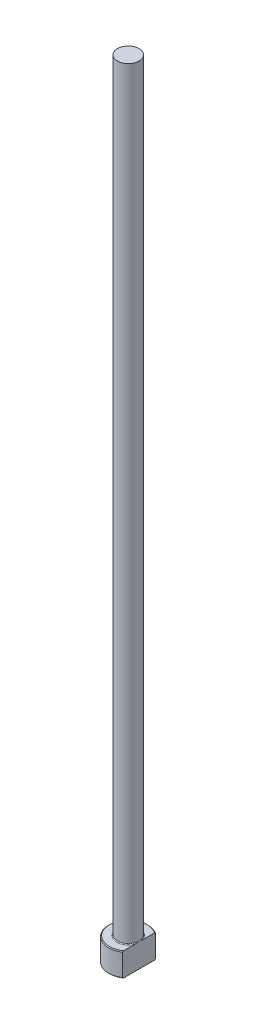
ISO-10303-21;
HEADER;
FILE_DESCRIPTION(('STEP AP214'),'2;1');
FILE_NAME('part.step','',(''),(''),'','','');
FILE_SCHEMA(('AUTOMOTIVE_DESIGN { 1 0 10303 214 1 1 1 1 }'));
ENDSEC;
DATA;
#1=APPLICATION_CONTEXT('core data for automotive mechanical design processes');
#2=APPLICATION_PROTOCOL_DEFINITION('international standard','automotive_design',2000,#1);
#3=PRODUCT_CONTEXT('',#1,'mechanical');
#4=PRODUCT('Part','Part','',(#3));
#5=PRODUCT_RELATED_PRODUCT_CATEGORY('part','',(#4));
#6=PRODUCT_DEFINITION_FORMATION('','',#4);
#7=PRODUCT_DEFINITION_CONTEXT('part definition',#1,'design');
#8=PRODUCT_DEFINITION('design','',#6,#7);
#9=PRODUCT_DEFINITION_SHAPE('','',#8);
#10=(LENGTH_UNIT() NAMED_UNIT(*) SI_UNIT(.MILLI.,.METRE.));
#11=(NAMED_UNIT(*) PLANE_ANGLE_UNIT() SI_UNIT($,.RADIAN.));
#12=(NAMED_UNIT(*) SI_UNIT($,.STERADIAN.) SOLID_ANGLE_UNIT());
#13=UNCERTAINTY_MEASURE_WITH_UNIT(LENGTH_MEASURE(1.E-05),#10,'distance_accuracy_value','');
#14=(GEOMETRIC_REPRESENTATION_CONTEXT(3) GLOBAL_UNCERTAINTY_ASSIGNED_CONTEXT((#13)) GLOBAL_UNIT_ASSIGNED_CONTEXT((#10,
#11,#12)) REPRESENTATION_CONTEXT('',''));
#15=CARTESIAN_POINT('',(0.,0.,0.));
#16=DIRECTION('',(0.,0.,1.));
#17=DIRECTION('',(1.,0.,0.));
#18=AXIS2_PLACEMENT_3D('',#15,#16,#17);
#19=CARTESIAN_POINT('',(0.,0.,0.));
#20=DIRECTION('',(0.,-1.,0.));
#21=DIRECTION('',(0.,0.,-1.));
#22=AXIS2_PLACEMENT_3D('',#19,#20,#21);
#23=PLANE('',#22);
#24=CARTESIAN_POINT('',(0.,0.,0.));
#25=DIRECTION('',(0.,-1.,0.));
#26=DIRECTION('',(0.,0.,-1.));
#27=AXIS2_PLACEMENT_3D('',#24,#25,#26);
#28=CIRCLE('',#27,4.79999999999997);
#29=CARTESIAN_POINT('',(2.74999999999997,0.,3.93414539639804));
#30=VERTEX_POINT('',#29);
#31=CARTESIAN_POINT('',(2.74999999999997,0.,-3.93414539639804));
#32=VERTEX_POINT('',#31);
#33=EDGE_CURVE('E98',#30,#32,#28,.T.);
#34=ORIENTED_EDGE('',*,*,#33,.T.);
#35=DIRECTION('',(0.,0.,1.));
#36=VECTOR('',#35,1.);
#37=CARTESIAN_POINT('',(2.74999999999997,0.,4.1758232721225));
#38=LINE('',#37,#36);
#39=EDGE_CURVE('E83',#32,#30,#38,.T.);
#40=ORIENTED_EDGE('',*,*,#39,.T.);
#41=EDGE_LOOP('',(#34,#40));
#42=FACE_BOUND('',#41,.T.);
#43=ADVANCED_FACE('F32',(#42),#23,.T.);
#44=CARTESIAN_POINT('',(0.,259.958771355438,0.));
#45=DIRECTION('',(0.,1.,0.));
#46=DIRECTION('',(0.,0.,1.));
#47=AXIS2_PLACEMENT_3D('',#44,#45,#46);
#48=CYLINDRICAL_SURFACE('',#47,4.99999999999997);
#49=CARTESIAN_POINT('',(0.,5.79999999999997,0.));
#50=DIRECTION('',(0.,1.,0.));
#51=DIRECTION('',(0.,0.,1.));
#52=AXIS2_PLACEMENT_3D('',#49,#50,#51);
#53=CIRCLE('',#52,4.99999999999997);
#54=CARTESIAN_POINT('',(2.74999999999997,5.79999999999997,4.1758232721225));
#55=VERTEX_POINT('',#54);
#56=CARTESIAN_POINT('',(2.74999999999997,5.79999999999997,-4.1758232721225));
#57=VERTEX_POINT('',#56);
#58=EDGE_CURVE('E104',#55,#57,#53,.F.);
#59=ORIENTED_EDGE('',*,*,#58,.T.);
#60=DIRECTION('',(0.,-1.,0.));
#61=VECTOR('',#60,1.);
#62=CARTESIAN_POINT('',(2.74999999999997,200.,-4.1758232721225));
#63=LINE('',#62,#61);
#64=CARTESIAN_POINT('',(2.74999999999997,0.200000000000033,-4.1758232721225));
#65=VERTEX_POINT('',#64);
#66=EDGE_CURVE('E183',#57,#65,#63,.T.);
#67=ORIENTED_EDGE('',*,*,#66,.T.);
#68=CARTESIAN_POINT('',(0.,0.200000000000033,0.));
#69=DIRECTION('',(0.,-1.,0.));
#70=DIRECTION('',(0.,0.,-1.));
#71=AXIS2_PLACEMENT_3D('',#68,#69,#70);
#72=CIRCLE('',#71,4.99999999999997);
#73=CARTESIAN_POINT('',(2.74999999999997,0.200000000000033,4.1758232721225));
#74=VERTEX_POINT('',#73);
#75=EDGE_CURVE('E100',#65,#74,#72,.F.);
#76=ORIENTED_EDGE('',*,*,#75,.T.);
#77=DIRECTION('',(0.,-1.,0.));
#78=VECTOR('',#77,1.);
#79=CARTESIAN_POINT('',(2.74999999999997,200.,4.1758232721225));
#80=LINE('',#79,#78);
#81=EDGE_CURVE('E93',#55,#74,#80,.T.);
#82=ORIENTED_EDGE('',*,*,#81,.F.);
#83=EDGE_LOOP('',(#59,#67,#76,#82));
#84=FACE_BOUND('',#83,.T.);
#85=ADVANCED_FACE('F158',(#84),#48,.T.);
#86=CARTESIAN_POINT('',(-4.99999999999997,6.,0.));
#87=DIRECTION('',(0.,1.,0.));
#88=DIRECTION('',(0.,0.,1.));
#89=AXIS2_PLACEMENT_3D('',#86,#87,#88);
#90=PLANE('',#89);
#91=CARTESIAN_POINT('',(0.,6.,0.));
#92=DIRECTION('',(0.,1.,0.));
#93=DIRECTION('',(0.,0.,1.));
#94=AXIS2_PLACEMENT_3D('',#91,#92,#93);
#95=CIRCLE('',#94,4.79999999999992);
#96=CARTESIAN_POINT('',(2.74999999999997,6.,-3.93414539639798));
#97=VERTEX_POINT('',#96);
#98=CARTESIAN_POINT('',(2.74999999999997,6.,3.93414539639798));
#99=VERTEX_POINT('',#98);
#100=EDGE_CURVE('E178',#97,#99,#95,.T.);
#101=ORIENTED_EDGE('',*,*,#100,.T.);
#102=DIRECTION('',(0.,0.,-1.));
#103=VECTOR('',#102,1.);
#104=CARTESIAN_POINT('',(2.74999999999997,6.,0.));
#105=LINE('',#104,#103);
#106=CARTESIAN_POINT('',(2.74999999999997,5.99999999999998,1.06770782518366));
#107=VERTEX_POINT('',#106);
#108=EDGE_CURVE('E57',#99,#107,#105,.T.);
#109=ORIENTED_EDGE('',*,*,#108,.T.);
#110=CARTESIAN_POINT('',(0.,6.,0.));
#111=DIRECTION('',(0.,1.,0.));
#112=DIRECTION('',(0.,0.,1.));
#113=AXIS2_PLACEMENT_3D('',#110,#111,#112);
#114=CIRCLE('',#113,2.94999999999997);
#115=CARTESIAN_POINT('',(2.74999999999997,5.99999999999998,-1.06770782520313));
#116=VERTEX_POINT('',#115);
#117=EDGE_CURVE('E107',#107,#116,#114,.F.);
#118=ORIENTED_EDGE('',*,*,#117,.T.);
#119=EDGE_CURVE('E136',#116,#97,#105,.T.);
#120=ORIENTED_EDGE('',*,*,#119,.T.);
#121=EDGE_LOOP('',(#101,#109,#118,#120));
#122=FACE_BOUND('',#121,.T.);
#123=ADVANCED_FACE('F147',(#122),#90,.T.);
#124=CARTESIAN_POINT('',(0.,6.00000000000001,0.));
#125=DIRECTION('',(0.,-1.,0.));
#126=DIRECTION('',(0.,0.,-1.));
#127=AXIS2_PLACEMENT_3D('',#124,#125,#126);
#128=CONICAL_SURFACE('',#127,4.79999999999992,0.785398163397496);
#129=ORIENTED_EDGE('',*,*,#58,.F.);
#130=CARTESIAN_POINT('',(2.74999999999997,1.20885441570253,9.18844783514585));
#131=CARTESIAN_POINT('',(2.74999999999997,1.37523675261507,9.0147689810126));
#132=CARTESIAN_POINT('',(2.74999999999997,1.54142180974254,8.84090089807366));
#133=CARTESIAN_POINT('',(2.74999999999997,1.87331224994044,8.49270511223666));
#134=CARTESIAN_POINT('',(2.74999999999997,2.03901762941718,8.31837740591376));
#135=CARTESIAN_POINT('',(2.74999999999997,2.53536746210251,7.79449769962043));
#136=CARTESIAN_POINT('',(2.74999999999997,2.86516041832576,7.44413786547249));
#137=CARTESIAN_POINT('',(2.74999999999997,3.52140645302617,6.74030951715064));
#138=CARTESIAN_POINT('',(2.74999999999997,3.84785962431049,6.38684108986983));
#139=CARTESIAN_POINT('',(2.74999999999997,4.33353933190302,5.85303151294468));
#140=CARTESIAN_POINT('',(2.74999999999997,4.49475728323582,5.67450358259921));
#141=CARTESIAN_POINT('',(2.74999999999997,4.81545552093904,5.31589537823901));
#142=CARTESIAN_POINT('',(2.74999999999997,4.97493583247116,5.1358151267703));
#143=CARTESIAN_POINT('',(2.74999999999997,5.28246157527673,4.78409714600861));
#144=CARTESIAN_POINT('',(2.74999999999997,5.43063567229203,4.6125721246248));
#145=CARTESIAN_POINT('',(2.74999999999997,5.72427023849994,4.26717959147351));
#146=CARTESIAN_POINT('',(2.74999999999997,5.86973045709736,4.09331186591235));
#147=CARTESIAN_POINT('',(2.74999999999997,6.15716227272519,3.74214491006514));
#148=CARTESIAN_POINT('',(2.74999999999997,6.29912659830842,3.56483970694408));
#149=CARTESIAN_POINT('',(2.74999999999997,6.57763983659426,3.20603939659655));
#150=CARTESIAN_POINT('',(2.74999999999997,6.71418980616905,3.02454511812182));
#151=CARTESIAN_POINT('',(2.74999999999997,6.93857405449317,2.71219163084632));
#152=CARTESIAN_POINT('',(2.74999999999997,7.02851673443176,2.58285434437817));
#153=CARTESIAN_POINT('',(2.74999999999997,7.20308451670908,2.3205424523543));
#154=CARTESIAN_POINT('',(2.74999999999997,7.28770764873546,2.18756652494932));
#155=CARTESIAN_POINT('',(2.74999999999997,7.4493195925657,1.9173567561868));
#156=CARTESIAN_POINT('',(2.74999999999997,7.52632375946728,1.7801322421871));
#157=CARTESIAN_POINT('',(2.74999999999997,7.66966790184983,1.50031327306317));
#158=CARTESIAN_POINT('',(2.74999999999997,7.7360172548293,1.35772367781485));
#159=CARTESIAN_POINT('',(2.74999999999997,7.86065113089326,1.04856386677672));
#160=CARTESIAN_POINT('',(2.74999999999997,7.9170079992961,0.88117116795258));
#161=CARTESIAN_POINT('',(2.74999999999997,7.98102802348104,0.625229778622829));
#162=CARTESIAN_POINT('',(2.74999999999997,7.99893817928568,0.539229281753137));
#163=CARTESIAN_POINT('',(2.74999999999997,8.02707157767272,0.365959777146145));
#164=CARTESIAN_POINT('',(2.74999999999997,8.03729562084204,0.278690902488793));
#165=CARTESIAN_POINT('',(2.74999999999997,8.0494923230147,0.102763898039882));
#166=CARTESIAN_POINT('',(2.74999999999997,8.05138838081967,0.0141003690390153));
#167=CARTESIAN_POINT('',(2.74999999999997,8.04659669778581,-0.162990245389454));
#168=CARTESIAN_POINT('',(2.74999999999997,8.03990892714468,-0.251417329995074));
#169=CARTESIAN_POINT('',(2.74999999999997,8.01835539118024,-0.427430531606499));
#170=CARTESIAN_POINT('',(2.74999999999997,8.00347341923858,-0.515014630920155));
#171=CARTESIAN_POINT('',(2.74999999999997,7.9663672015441,-0.688602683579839));
#172=CARTESIAN_POINT('',(2.74999999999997,7.94414138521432,-0.774606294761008));
#173=CARTESIAN_POINT('',(2.74999999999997,7.88037969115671,-0.988315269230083));
#174=CARTESIAN_POINT('',(2.74999999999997,7.83478497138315,-1.11480587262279));
#175=CARTESIAN_POINT('',(2.74999999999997,7.7327190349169,-1.36329985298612));
#176=CARTESIAN_POINT('',(2.74999999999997,7.67623944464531,-1.48529968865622));
#177=CARTESIAN_POINT('',(2.74999999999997,7.5549822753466,-1.72582737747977));
#178=CARTESIAN_POINT('',(2.74999999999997,7.4901643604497,-1.84433466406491));
#179=CARTESIAN_POINT('',(2.74999999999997,7.38849038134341,-2.01944141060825));
#180=CARTESIAN_POINT('',(2.74999999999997,7.3538638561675,-2.07735876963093));
#181=CARTESIAN_POINT('',(2.74999999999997,7.28331846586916,-2.19239883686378));
#182=CARTESIAN_POINT('',(2.74999999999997,7.24739965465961,-2.24952157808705));
#183=CARTESIAN_POINT('',(2.74999999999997,7.12488368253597,-2.44019263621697));
#184=CARTESIAN_POINT('',(2.74999999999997,7.0357483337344,-2.57211125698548));
#185=CARTESIAN_POINT('',(2.74999999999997,6.85300432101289,-2.83282496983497));
#186=CARTESIAN_POINT('',(2.74999999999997,6.75939460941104,-2.96161931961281));
#187=CARTESIAN_POINT('',(2.74999999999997,6.5687848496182,-3.2168121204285));
#188=CARTESIAN_POINT('',(2.74999999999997,6.47178237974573,-3.34320875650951));
#189=CARTESIAN_POINT('',(2.74999999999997,6.275243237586,-3.59402090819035));
#190=CARTESIAN_POINT('',(2.74999999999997,6.17570641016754,-3.71843630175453));
#191=CARTESIAN_POINT('',(2.74999999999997,5.97442282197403,-3.96596722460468));
#192=CARTESIAN_POINT('',(2.74999999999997,5.87267126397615,-4.08907884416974));
#193=CARTESIAN_POINT('',(2.74999999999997,5.6676012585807,-4.33399167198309));
#194=CARTESIAN_POINT('',(2.74999999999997,5.56428277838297,-4.45579285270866));
#195=CARTESIAN_POINT('',(2.74999999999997,5.25255029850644,-4.81947940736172));
#196=CARTESIAN_POINT('',(2.74999999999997,5.04226620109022,-5.0597609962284));
#197=CARTESIAN_POINT('',(2.74999999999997,4.61812846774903,-5.53760543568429));
#198=CARTESIAN_POINT('',(2.74999999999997,4.40427119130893,-5.77516503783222));
#199=CARTESIAN_POINT('',(2.74999999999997,3.97415714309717,-6.24814387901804));
#200=CARTESIAN_POINT('',(2.74999999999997,3.75790012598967,-6.48356289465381));
#201=CARTESIAN_POINT('',(2.74999999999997,3.32391192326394,-6.95249982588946));
#202=CARTESIAN_POINT('',(2.74999999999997,3.10618287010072,-7.18601971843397));
#203=CARTESIAN_POINT('',(2.74999999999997,2.66941287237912,-7.65182952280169));
#204=CARTESIAN_POINT('',(2.74999999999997,2.45037192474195,-7.88411943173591));
#205=CARTESIAN_POINT('',(2.74999999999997,2.14586495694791,-8.2056307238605));
#206=CARTESIAN_POINT('',(2.74999999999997,2.06083046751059,-8.29526139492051));
#207=CARTESIAN_POINT('',(2.74999999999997,1.89060889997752,-8.47440444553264));
#208=CARTESIAN_POINT('',(2.74999999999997,1.80542180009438,-8.56391680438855));
#209=CARTESIAN_POINT('',(2.74999999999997,1.63506457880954,-8.74266965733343));
#210=CARTESIAN_POINT('',(2.74999999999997,1.54989467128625,-8.83191035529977));
#211=CARTESIAN_POINT('',(2.74999999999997,1.37945223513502,-9.01026683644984));
#212=CARTESIAN_POINT('',(2.74999999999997,1.2941797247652,-9.09938263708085));
#213=CARTESIAN_POINT('',(2.74999999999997,1.20885441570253,-9.18844783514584));
#214=B_SPLINE_CURVE_WITH_KNOTS('',3,(#130,#131,#132,#133,#134,#135,#136,#137,#138,#139,#140,
#141,#142,#143,#144,#145,#146,#147,#148,#149,#150,#151,#152,#153,#154,#155,#156,#157,#158,#159,
#160,#161,#162,#163,#164,#165,#166,#167,#168,#169,#170,#171,#172,#173,#174,#175,#176,#177,#178,
#179,#180,#181,#182,#183,#184,#185,#186,#187,#188,#189,#190,#191,#192,#193,#194,#195,#196,#197,
#198,#199,#200,#201,#202,#203,#204,#205,#206,#207,#208,#209,#210,#211,#212,#213),.UNSPECIFIED.,
.F.,.F.,(4,2,2,2,2,2,2,2,2,2,2,2,2,2,2,2,2,2,2,2,2,2,2,2,2,2,2,2,2,2,2,2,2,2,2,2,2,2,2,2,2,4),
(0.,0.721544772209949,1.4430949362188,2.88656432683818,4.32999349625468,5.05163004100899,
5.77325612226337,6.45322671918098,7.13325979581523,7.81460476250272,8.49581607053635,
8.96833065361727,9.44101923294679,9.91273488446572,10.3840330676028,10.9119743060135,
11.1752192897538,11.4384368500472,11.7040704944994,11.9697050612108,12.2358669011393,
12.5020857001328,12.9047274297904,13.3076801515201,13.712661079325,13.9150857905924,
14.1175020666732,14.5949844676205,15.0725792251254,15.5505221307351,16.0284943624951,
16.5076321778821,16.9867800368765,17.9446362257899,18.9035363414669,19.862535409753,
20.8203587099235,21.7781842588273,22.1488332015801,22.5195401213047,22.889621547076,
23.259644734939),.UNSPECIFIED.);
#215=EDGE_CURVE('E135',#55,#99,#214,.T.);
#216=ORIENTED_EDGE('',*,*,#215,.T.);
#217=ORIENTED_EDGE('',*,*,#100,.F.);
#218=EDGE_CURVE('E127',#97,#57,#214,.T.);
#219=ORIENTED_EDGE('',*,*,#218,.T.);
#220=EDGE_LOOP('',(#129,#216,#217,#219));
#221=FACE_BOUND('',#220,.T.);
#222=ADVANCED_FACE('F143',(#221),#128,.T.);
#223=CARTESIAN_POINT('',(0.,0.200000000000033,0.));
#224=DIRECTION('',(0.,1.,0.));
#225=DIRECTION('',(0.,0.,1.));
#226=AXIS2_PLACEMENT_3D('',#223,#224,#225);
#227=CONICAL_SURFACE('',#226,4.99999999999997,0.785398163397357);
#228=ORIENTED_EDGE('',*,*,#75,.F.);
#229=CARTESIAN_POINT('',(2.74999999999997,4.79114558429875,-9.18844783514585));
#230=CARTESIAN_POINT('',(2.74999999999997,4.62476324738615,-9.01476898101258));
#231=CARTESIAN_POINT('',(2.74999999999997,4.45857819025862,-8.84090089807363));
#232=CARTESIAN_POINT('',(2.74999999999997,4.12668775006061,-8.49270511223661));
#233=CARTESIAN_POINT('',(2.74999999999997,3.9609823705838,-8.3183774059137));
#234=CARTESIAN_POINT('',(2.74999999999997,3.4646325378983,-7.79449769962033));
#235=CARTESIAN_POINT('',(2.74999999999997,3.13483958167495,-7.44413786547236));
#236=CARTESIAN_POINT('',(2.74999999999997,2.47859354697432,-6.74030951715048));
#237=CARTESIAN_POINT('',(2.74999999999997,2.15214037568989,-6.38684108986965));
#238=CARTESIAN_POINT('',(2.74999999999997,1.66646066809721,-5.85303151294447));
#239=CARTESIAN_POINT('',(2.74999999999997,1.50524271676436,-5.674503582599));
#240=CARTESIAN_POINT('',(2.74999999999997,1.18454447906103,-5.31589537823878));
#241=CARTESIAN_POINT('',(2.74999999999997,1.02506416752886,-5.13581512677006));
#242=CARTESIAN_POINT('',(2.74999999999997,0.717538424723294,-4.78409714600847));
#243=CARTESIAN_POINT('',(2.74999999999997,0.569364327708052,-4.61257212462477));
#244=CARTESIAN_POINT('',(2.74999999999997,0.275729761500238,-4.26717959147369));
#245=CARTESIAN_POINT('',(2.74999999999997,0.130269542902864,-4.09331186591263));
#246=CARTESIAN_POINT('',(2.74999999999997,-0.157162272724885,-3.74214491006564));
#247=CARTESIAN_POINT('',(2.74999999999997,-0.299126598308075,-3.56483970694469));
#248=CARTESIAN_POINT('',(2.74999999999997,-0.57763983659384,-3.20603939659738));
#249=CARTESIAN_POINT('',(2.74999999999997,-0.714189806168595,-3.02454511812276));
#250=CARTESIAN_POINT('',(2.74999999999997,-0.938574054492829,-2.71219163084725));
#251=CARTESIAN_POINT('',(2.74999999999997,-1.02851673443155,-2.58285434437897));
#252=CARTESIAN_POINT('',(2.74999999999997,-1.20308451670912,-2.32054245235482));
#253=CARTESIAN_POINT('',(2.74999999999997,-1.28770764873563,-2.18756652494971));
#254=CARTESIAN_POINT('',(2.74999999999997,-1.4493195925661,-1.91735675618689));
#255=CARTESIAN_POINT('',(2.74999999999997,-1.52632375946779,-1.78013224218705));
#256=CARTESIAN_POINT('',(2.74999999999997,-1.66966790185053,-1.50031327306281));
#257=CARTESIAN_POINT('',(2.74999999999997,-1.73601725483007,-1.35772367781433));
#258=CARTESIAN_POINT('',(2.74999999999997,-1.86065113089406,-1.04856386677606));
#259=CARTESIAN_POINT('',(2.74999999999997,-1.91700799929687,-0.881171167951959));
#260=CARTESIAN_POINT('',(2.74999999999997,-1.98102802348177,-0.625229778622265));
#261=CARTESIAN_POINT('',(2.74999999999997,-1.99893817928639,-0.539229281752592));
#262=CARTESIAN_POINT('',(2.74999999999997,-2.0270715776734,-0.365959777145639));
#263=CARTESIAN_POINT('',(2.74999999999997,-2.0372956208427,-0.278690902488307));
#264=CARTESIAN_POINT('',(2.74999999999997,-2.04949232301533,-0.102763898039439));
#265=CARTESIAN_POINT('',(2.74999999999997,-2.0513883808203,-0.0141003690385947));
#266=CARTESIAN_POINT('',(2.74999999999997,-2.04659669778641,0.162990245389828));
#267=CARTESIAN_POINT('',(2.74999999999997,-2.03990892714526,0.251417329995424));
#268=CARTESIAN_POINT('',(2.74999999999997,-2.01835539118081,0.427430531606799));
#269=CARTESIAN_POINT('',(2.74999999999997,-2.00347341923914,0.515014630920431));
#270=CARTESIAN_POINT('',(2.74999999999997,-1.96636720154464,0.688602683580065));
#271=CARTESIAN_POINT('',(2.74999999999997,-1.94414138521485,0.774606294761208));
#272=CARTESIAN_POINT('',(2.74999999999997,-1.88037969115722,0.988315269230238));
#273=CARTESIAN_POINT('',(2.74999999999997,-1.83478497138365,1.11480587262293));
#274=CARTESIAN_POINT('',(2.74999999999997,-1.73271903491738,1.36329985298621));
#275=CARTESIAN_POINT('',(2.74999999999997,-1.67623944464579,1.48529968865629));
#276=CARTESIAN_POINT('',(2.74999999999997,-1.55498227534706,1.7258273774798));
#277=CARTESIAN_POINT('',(2.74999999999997,-1.49016436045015,1.84433466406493));
#278=CARTESIAN_POINT('',(2.74999999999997,-1.38849038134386,2.01944141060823));
#279=CARTESIAN_POINT('',(2.74999999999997,-1.35386385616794,2.07735876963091));
#280=CARTESIAN_POINT('',(2.74999999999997,-1.28331846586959,2.19239883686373));
#281=CARTESIAN_POINT('',(2.74999999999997,-1.24739965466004,2.24952157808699));
#282=CARTESIAN_POINT('',(2.74999999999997,-1.1248836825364,2.44019263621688));
#283=CARTESIAN_POINT('',(2.74999999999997,-1.03574833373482,2.57211125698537));
#284=CARTESIAN_POINT('',(2.74999999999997,-0.853004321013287,2.83282496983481));
#285=CARTESIAN_POINT('',(2.74999999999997,-0.759394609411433,2.96161931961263));
#286=CARTESIAN_POINT('',(2.74999999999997,-0.568784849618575,3.21681212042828));
#287=CARTESIAN_POINT('',(2.74999999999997,-0.471782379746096,3.34320875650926));
#288=CARTESIAN_POINT('',(2.74999999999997,-0.275243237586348,3.59402090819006));
#289=CARTESIAN_POINT('',(2.74999999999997,-0.17570641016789,3.71843630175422));
#290=CARTESIAN_POINT('',(2.74999999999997,0.0255771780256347,3.96596722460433));
#291=CARTESIAN_POINT('',(2.74999999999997,0.127328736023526,4.08907884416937));
#292=CARTESIAN_POINT('',(2.74999999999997,0.332398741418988,4.33399167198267));
#293=CARTESIAN_POINT('',(2.74999999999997,0.435717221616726,4.45579285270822));
#294=CARTESIAN_POINT('',(2.74999999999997,0.747449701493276,4.81947940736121));
#295=CARTESIAN_POINT('',(2.74999999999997,0.957733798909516,5.05976099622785));
#296=CARTESIAN_POINT('',(2.74999999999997,1.38187153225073,5.53760543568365));
#297=CARTESIAN_POINT('',(2.74999999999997,1.59572880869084,5.77516503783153));
#298=CARTESIAN_POINT('',(2.74999999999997,2.02584285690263,6.24814387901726));
#299=CARTESIAN_POINT('',(2.74999999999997,2.24209987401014,6.48356289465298));
#300=CARTESIAN_POINT('',(2.74999999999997,2.6760880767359,6.95249982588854));
#301=CARTESIAN_POINT('',(2.74999999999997,2.89381712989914,7.18601971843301));
#302=CARTESIAN_POINT('',(2.74999999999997,3.33058712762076,7.65182952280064));
#303=CARTESIAN_POINT('',(2.74999999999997,3.54962807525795,7.88411943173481));
#304=CARTESIAN_POINT('',(2.74999999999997,3.85413504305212,8.20563072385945));
#305=CARTESIAN_POINT('',(2.74999999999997,3.93916953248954,8.29526139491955));
#306=CARTESIAN_POINT('',(2.74999999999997,4.10939110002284,8.47440444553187));
#307=CARTESIAN_POINT('',(2.74999999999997,4.1945781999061,8.56391680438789));
#308=CARTESIAN_POINT('',(2.74999999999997,4.36493542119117,8.74266965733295));
#309=CARTESIAN_POINT('',(2.74999999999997,4.45010532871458,8.8319103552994));
#310=CARTESIAN_POINT('',(2.74999999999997,4.62054776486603,9.01026683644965));
#311=CARTESIAN_POINT('',(2.74999999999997,4.70582027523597,9.09938263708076));
#312=CARTESIAN_POINT('',(2.74999999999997,4.79114558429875,9.18844783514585));
#313=B_SPLINE_CURVE_WITH_KNOTS('',3,(#229,#230,#231,#232,#233,#234,#235,#236,#237,#238,#239,
#240,#241,#242,#243,#244,#245,#246,#247,#248,#249,#250,#251,#252,#253,#254,#255,#256,#257,#258,
#259,#260,#261,#262,#263,#264,#265,#266,#267,#268,#269,#270,#271,#272,#273,#274,#275,#276,#277,
#278,#279,#280,#281,#282,#283,#284,#285,#286,#287,#288,#289,#290,#291,#292,#293,#294,#295,#296,
#297,#298,#299,#300,#301,#302,#303,#304,#305,#306,#307,#308,#309,#310,#311,#312),.UNSPECIFIED.,
.F.,.F.,(4,2,2,2,2,2,2,2,2,2,2,2,2,2,2,2,2,2,2,2,2,2,2,2,2,2,2,2,2,2,2,2,2,2,2,2,2,2,2,2,2,4),
(0.,0.721544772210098,1.4430949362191,2.88656432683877,4.32999349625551,5.05163004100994,
5.77325612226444,6.45322671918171,7.13325979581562,7.81460476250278,8.49581607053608,
8.96833065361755,9.44101923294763,9.91273488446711,10.3840330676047,10.9119743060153,
11.1752192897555,11.4384368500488,11.704070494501,11.9697050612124,12.2358669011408,
12.5020857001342,12.9047274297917,13.3076801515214,13.7126610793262,13.9150857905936,
14.1175020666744,14.5949844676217,15.0725792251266,15.5505221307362,16.0284943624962,
16.5076321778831,16.9867800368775,17.9446362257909,18.9035363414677,19.8625354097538,
20.8203587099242,21.7781842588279,22.1488332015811,22.5195401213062,22.8896215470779,
23.2596447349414),.UNSPECIFIED.);
#314=EDGE_CURVE('E86',#65,#32,#313,.T.);
#315=ORIENTED_EDGE('',*,*,#314,.T.);
#316=ORIENTED_EDGE('',*,*,#33,.F.);
#317=EDGE_CURVE('E89',#30,#74,#313,.T.);
#318=ORIENTED_EDGE('',*,*,#317,.T.);
#319=EDGE_LOOP('',(#228,#315,#316,#318));
#320=FACE_BOUND('',#319,.T.);
#321=ADVANCED_FACE('F97',(#320),#227,.T.);
#322=CARTESIAN_POINT('',(0.,6.19999999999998,0.));
#323=DIRECTION('',(0.,1.,0.));
#324=DIRECTION('',(0.,0.,1.));
#325=AXIS2_PLACEMENT_3D('',#322,#323,#324);
#326=TOROIDAL_SURFACE('',#325,2.94999999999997,0.2);
#327=CARTESIAN_POINT('',(2.74999999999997,6.19999999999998,0.));
#328=CARTESIAN_POINT('',(2.74999999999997,6.20000050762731,1.12997189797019E-10));
#329=CARTESIAN_POINT('',(2.74999999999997,6.20000101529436,-1.81527538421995E-07));
#330=CARTESIAN_POINT('',(2.74999999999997,6.20000196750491,-6.94840321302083E-07));
#331=CARTESIAN_POINT('',(2.74999999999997,6.20000240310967,-1.03787718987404E-06));
#332=CARTESIAN_POINT('',(2.74999999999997,6.20000330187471,-1.85808129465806E-06));
#333=CARTESIAN_POINT('',(2.74999999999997,6.20000375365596,-2.34835983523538E-06));
#334=CARTESIAN_POINT('',(2.74999999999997,6.20000456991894,-3.37046961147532E-06));
#335=CARTESIAN_POINT('',(2.74999999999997,6.20000493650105,-3.90074161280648E-06));
#336=CARTESIAN_POINT('',(2.74999999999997,6.20000627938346,-5.93261734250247E-06));
#337=CARTESIAN_POINT('',(2.74999999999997,6.20000718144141,-7.48563177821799E-06));
#338=CARTESIAN_POINT('',(2.74999999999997,6.20000868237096,-1.05790083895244E-05));
#339=CARTESIAN_POINT('',(2.74999999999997,6.20000929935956,-1.21109700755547E-05));
#340=CARTESIAN_POINT('',(2.74999999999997,6.20001185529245,-1.85322193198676E-05));
#341=CARTESIAN_POINT('',(2.74999999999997,6.20001373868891,-2.34472712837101E-05));
#342=CARTESIAN_POINT('',(2.74999999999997,6.20001654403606,-3.27779453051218E-05));
#343=CARTESIAN_POINT('',(2.74999999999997,6.20001756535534,-3.71636224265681E-05));
#344=CARTESIAN_POINT('',(2.74999999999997,6.20002495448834,-6.95743734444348E-05));
#345=CARTESIAN_POINT('',(2.74999999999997,6.20003050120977,-9.77394526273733E-05));
#346=CARTESIAN_POINT('',(2.74999999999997,6.20005478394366,-0.000208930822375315));
#347=CARTESIAN_POINT('',(2.74999999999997,6.20007801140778,-0.000290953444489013));
#348=CARTESIAN_POINT('',(2.74999999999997,6.20016837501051,-0.000615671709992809));
#349=CARTESIAN_POINT('',(2.74999999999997,6.20023256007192,-0.000858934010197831));
#350=CARTESIAN_POINT('',(2.74999999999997,6.20048946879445,-0.00182516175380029));
#351=CARTESIAN_POINT('',(2.74999999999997,6.20068588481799,-0.00254739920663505));
#352=CARTESIAN_POINT('',(2.74999999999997,6.2015014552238,-0.00555461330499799));
#353=CARTESIAN_POINT('',(2.74999999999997,6.20211597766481,-0.00784050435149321));
#354=CARTESIAN_POINT('',(2.74999999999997,6.2075464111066,-0.028030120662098));
#355=CARTESIAN_POINT('',(2.74999999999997,6.21238054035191,-0.045930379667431));
#356=CARTESIAN_POINT('',(2.74999999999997,6.22182435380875,-0.0810299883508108));
#357=CARTESIAN_POINT('',(2.74999999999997,6.22643534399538,-0.0982290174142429));
#358=CARTESIAN_POINT('',(2.74999999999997,6.23620184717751,-0.134808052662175));
#359=CARTESIAN_POINT('',(2.74999999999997,6.24135263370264,-0.154189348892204));
#360=CARTESIAN_POINT('',(2.74999999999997,6.25163624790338,-0.19318178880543));
#361=CARTESIAN_POINT('',(2.74999999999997,6.25676827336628,-0.212793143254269));
#362=CARTESIAN_POINT('',(2.74999999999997,6.26905119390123,-0.260223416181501));
#363=CARTESIAN_POINT('',(2.74999999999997,6.27615177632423,-0.288055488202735));
#364=CARTESIAN_POINT('',(2.74999999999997,6.28988618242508,-0.343037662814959));
#365=CARTESIAN_POINT('',(2.74999999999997,6.29652742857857,-0.37018592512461));
#366=CARTESIAN_POINT('',(2.74999999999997,6.3179119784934,-0.460013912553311));
#367=CARTESIAN_POINT('',(2.74999999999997,6.33192996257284,-0.522872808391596));
#368=CARTESIAN_POINT('',(2.74999999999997,6.35724782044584,-0.649858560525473));
#369=CARTESIAN_POINT('',(2.74999999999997,6.36851625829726,-0.71399176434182));
#370=CARTESIAN_POINT('',(2.74999999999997,6.38744836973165,-0.848144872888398));
#371=CARTESIAN_POINT('',(2.74999999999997,6.39474814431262,-0.918222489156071));
#372=CARTESIAN_POINT('',(2.74999999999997,6.39971832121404,-1.02344881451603));
#373=CARTESIAN_POINT('',(2.74999999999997,6.40038441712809,-1.05845158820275));
#374=CARTESIAN_POINT('',(2.74999999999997,6.39917295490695,-1.1284044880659));
#375=CARTESIAN_POINT('',(2.74999999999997,6.39729798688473,-1.16335463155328));
#376=CARTESIAN_POINT('',(2.74999999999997,6.39199994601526,-1.21505383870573));
#377=CARTESIAN_POINT('',(2.74999999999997,6.38986571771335,-1.23193598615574));
#378=CARTESIAN_POINT('',(2.74999999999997,6.38464996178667,-1.2655715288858));
#379=CARTESIAN_POINT('',(2.74999999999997,6.38156766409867,-1.28232480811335));
#380=CARTESIAN_POINT('',(2.74999999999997,6.37431364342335,-1.31540767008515));
#381=CARTESIAN_POINT('',(2.74999999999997,6.37015411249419,-1.33173987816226));
#382=CARTESIAN_POINT('',(2.74999999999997,6.36048976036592,-1.36399299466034));
#383=CARTESIAN_POINT('',(2.74999999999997,6.35498646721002,-1.37991434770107));
#384=CARTESIAN_POINT('',(2.74999999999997,6.34222746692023,-1.41123903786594));
#385=CARTESIAN_POINT('',(2.74999999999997,6.33495457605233,-1.42663549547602));
#386=CARTESIAN_POINT('',(2.74999999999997,6.318175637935,-1.45617471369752));
#387=CARTESIAN_POINT('',(2.74999999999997,6.30867792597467,-1.4703218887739));
#388=CARTESIAN_POINT('',(2.74999999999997,6.29277007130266,-1.48907990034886));
#389=CARTESIAN_POINT('',(2.74999999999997,6.2875192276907,-1.49466894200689));
#390=CARTESIAN_POINT('',(2.74999999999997,6.27634440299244,-1.50515028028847));
#391=CARTESIAN_POINT('',(2.74999999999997,6.27042002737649,-1.51004216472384));
#392=CARTESIAN_POINT('',(2.74999999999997,6.25778482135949,-1.51891099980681));
#393=CARTESIAN_POINT('',(2.74999999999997,6.2510643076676,-1.52287446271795));
#394=CARTESIAN_POINT('',(2.74999999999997,6.23698143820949,-1.52941740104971));
#395=CARTESIAN_POINT('',(2.74999999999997,6.22962116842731,-1.53200119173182));
#396=CARTESIAN_POINT('',(2.74999999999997,6.2166326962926,-1.53496289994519));
#397=CARTESIAN_POINT('',(2.74999999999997,6.2110985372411,-1.53575651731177));
#398=CARTESIAN_POINT('',(2.74999999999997,6.19997558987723,-1.53638738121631));
#399=CARTESIAN_POINT('',(2.74999999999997,6.19438682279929,-1.53622498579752));
#400=CARTESIAN_POINT('',(2.74999999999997,6.18332943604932,-1.53495937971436));
#401=CARTESIAN_POINT('',(2.74999999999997,6.17786061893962,-1.53385785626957));
#402=CARTESIAN_POINT('',(2.74999999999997,6.16716525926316,-1.53080991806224));
#403=CARTESIAN_POINT('',(2.74999999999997,6.16193889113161,-1.52886290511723));
#404=CARTESIAN_POINT('',(2.74999999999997,6.14983366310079,-1.52335528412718));
#405=CARTESIAN_POINT('',(2.74999999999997,6.14310699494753,-1.51946144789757));
#406=CARTESIAN_POINT('',(2.74999999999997,6.13035821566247,-1.51065443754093));
#407=CARTESIAN_POINT('',(2.74999999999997,6.12433789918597,-1.5057387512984));
#408=CARTESIAN_POINT('',(2.74999999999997,6.10956608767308,-1.4920109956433));
#409=CARTESIAN_POINT('',(2.74999999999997,6.10134587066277,-1.48263193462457));
#410=CARTESIAN_POINT('',(2.74999999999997,6.08638427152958,-1.46278796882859));
#411=CARTESIAN_POINT('',(2.74999999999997,6.07964511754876,-1.45232146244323));
#412=CARTESIAN_POINT('',(2.74999999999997,6.06171675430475,-1.42080727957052));
#413=CARTESIAN_POINT('',(2.74999999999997,6.05211924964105,-1.39886385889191));
#414=CARTESIAN_POINT('',(2.74999999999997,6.03592584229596,-1.35377597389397));
#415=CARTESIAN_POINT('',(2.74999999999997,6.02935693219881,-1.33062268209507));
#416=CARTESIAN_POINT('',(2.74999999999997,6.01641276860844,-1.27469229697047));
#417=CARTESIAN_POINT('',(2.74999999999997,6.01110503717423,-1.24167224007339));
#418=CARTESIAN_POINT('',(2.74999999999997,6.00364182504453,-1.17522319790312));
#419=CARTESIAN_POINT('',(2.74999999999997,6.00149608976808,-1.1417932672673));
#420=CARTESIAN_POINT('',(2.74999999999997,5.99965905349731,-1.07618467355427));
#421=CARTESIAN_POINT('',(2.74999999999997,5.9998750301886,-1.04400821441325));
#422=CARTESIAN_POINT('',(2.74999999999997,6.00208041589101,-0.979705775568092));
#423=CARTESIAN_POINT('',(2.74999999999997,6.0040708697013,-0.947579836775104));
#424=CARTESIAN_POINT('',(2.74999999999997,6.01231998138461,-0.849711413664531));
#425=CARTESIAN_POINT('',(2.74999999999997,6.0208659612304,-0.784164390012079));
#426=CARTESIAN_POINT('',(2.74999999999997,6.04217753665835,-0.65215352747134));
#427=CARTESIAN_POINT('',(2.74999999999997,6.05504187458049,-0.585706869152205));
#428=CARTESIAN_POINT('',(2.74999999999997,6.07899589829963,-0.474257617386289));
#429=CARTESIAN_POINT('',(2.74999999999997,6.08936705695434,-0.429096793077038));
#430=CARTESIAN_POINT('',(2.74999999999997,6.11088695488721,-0.339494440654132));
#431=CARTESIAN_POINT('',(2.74999999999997,6.1220257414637,-0.295050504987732));
#432=CARTESIAN_POINT('',(2.74999999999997,6.14355229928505,-0.211341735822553));
#433=CARTESIAN_POINT('',(2.74999999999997,6.15388178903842,-0.172061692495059));
#434=CARTESIAN_POINT('',(2.74999999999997,6.17523671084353,-0.0918970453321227));
#435=CARTESIAN_POINT('',(2.74999999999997,6.18627305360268,-0.0510152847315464));
#436=CARTESIAN_POINT('',(2.74999999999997,6.19788514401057,-0.00783595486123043));
#437=CARTESIAN_POINT('',(2.74999999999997,6.19850096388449,-0.00554554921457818));
#438=CARTESIAN_POINT('',(2.74999999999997,6.19931683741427,-0.0025373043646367));
#439=CARTESIAN_POINT('',(2.74999999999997,6.19951229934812,-0.00181855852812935));
#440=CARTESIAN_POINT('',(2.74999999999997,6.19976804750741,-0.000856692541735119));
#441=CARTESIAN_POINT('',(2.74999999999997,6.19983200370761,-0.000614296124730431));
#442=CARTESIAN_POINT('',(2.74999999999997,6.19992209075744,-0.000290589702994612));
#443=CARTESIAN_POINT('',(2.74999999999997,6.19994527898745,-0.000208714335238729));
#444=CARTESIAN_POINT('',(2.74999999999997,6.19996952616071,-9.76928431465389E-05));
#445=CARTESIAN_POINT('',(2.74999999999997,6.19997506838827,-6.95486159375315E-05));
#446=CARTESIAN_POINT('',(2.74999999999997,6.19998244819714,-3.7159091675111E-05));
#447=CARTESIAN_POINT('',(2.74999999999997,6.19998346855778,-3.27745922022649E-05));
#448=CARTESIAN_POINT('',(2.74999999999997,6.19998627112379,-2.34463159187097E-05));
#449=CARTESIAN_POINT('',(2.74999999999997,6.19998815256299,-1.85324215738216E-05));
#450=CARTESIAN_POINT('',(2.74999999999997,6.19999070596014,-1.21123670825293E-05));
#451=CARTESIAN_POINT('',(2.74999999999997,6.19999132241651,-1.05804935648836E-05));
#452=CARTESIAN_POINT('',(2.74999999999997,6.19999282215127,-7.48720405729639E-06));
#453=CARTESIAN_POINT('',(2.74999999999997,6.19999372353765,-5.93417788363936E-06));
#454=CARTESIAN_POINT('',(2.74999999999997,6.19999506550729,-3.90218207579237E-06));
#455=CARTESIAN_POINT('',(2.74999999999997,6.19999543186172,-3.37185002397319E-06));
#456=CARTESIAN_POINT('',(2.74999999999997,6.19999624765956,-2.34957905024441E-06));
#457=CARTESIAN_POINT('',(2.74999999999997,6.19999669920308,-1.8591980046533E-06));
#458=CARTESIAN_POINT('',(2.74999999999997,6.19999759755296,-1.0387521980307E-06));
#459=CARTESIAN_POINT('',(2.74999999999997,6.19999803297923,-6.95584903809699E-07));
#460=CARTESIAN_POINT('',(2.74999999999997,6.19999898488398,-1.81944082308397E-07));
#461=CARTESIAN_POINT('',(2.74999999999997,6.19999949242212,-1.12986177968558E-10));
#462=CARTESIAN_POINT('',(2.74999999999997,6.19999999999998,0.));
#463=B_SPLINE_CURVE_WITH_KNOTS('',3,(#327,#328,#329,#330,#331,#332,#333,#334,#335,#336,#337,
#338,#339,#340,#341,#342,#343,#344,#345,#346,#347,#348,#349,#350,#351,#352,#353,#354,#355,#356,
#357,#358,#359,#360,#361,#362,#363,#364,#365,#366,#367,#368,#369,#370,#371,#372,#373,#374,#375,
#376,#377,#378,#379,#380,#381,#382,#383,#384,#385,#386,#387,#388,#389,#390,#391,#392,#393,#394,
#395,#396,#397,#398,#399,#400,#401,#402,#403,#404,#405,#406,#407,#408,#409,#410,#411,#412,#413,
#414,#415,#416,#417,#418,#419,#420,#421,#422,#423,#424,#425,#426,#427,#428,#429,#430,#431,#432,
#433,#434,#435,#436,#437,#438,#439,#440,#441,#442,#443,#444,#445,#446,#447,#448,#449,#450,#451,
#452,#453,#454,#455,#456,#457,#458,#459,#460,#461,#462),.UNSPECIFIED.,.T.,.F.,(4,2,2,2,2,2,2,2,
2,2,2,2,2,2,2,2,2,2,2,2,2,2,2,2,2,2,2,2,2,2,2,2,2,2,2,2,2,2,2,2,2,2,2,2,2,2,2,2,2,2,2,2,2,2,2,2,
2,2,2,2,2,2,2,2,2,2,2,4),(0.,1.53302756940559E-06,3.19538918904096E-06,5.18410384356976E-06,
7.11680690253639E-06,1.2484326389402E-05,1.74346119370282E-05,3.31954282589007E-05,
4.66876451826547E-05,0.000132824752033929,0.000388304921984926,0.00114333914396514,
0.00338841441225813,0.0104899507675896,0.0661127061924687,0.119532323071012,0.179694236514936,
0.240509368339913,0.326678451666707,0.410524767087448,0.603684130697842,0.79895806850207,
1.0099765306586,1.1149423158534,1.21980118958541,1.27083021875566,1.32190080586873,
1.37241688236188,1.42287578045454,1.47384571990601,1.52462767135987,1.54758745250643,
1.57056075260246,1.59384955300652,1.6170650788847,1.63376109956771,1.65045086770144,
1.66711071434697,1.68378236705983,1.70696786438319,1.73021104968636,1.76741395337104,
1.80467244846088,1.87612299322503,1.94819858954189,2.04828679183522,2.14868283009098,
2.24515187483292,2.3416777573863,2.53976637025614,2.74273377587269,2.8817318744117,
3.01918106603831,3.14102752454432,3.2680585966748,3.27517420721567,3.27740842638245,
3.27816077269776,3.27841579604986,3.27850186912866,3.27851535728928,3.27853111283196,
3.27853606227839,3.27854142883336,3.27854336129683,3.27854534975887,3.27854701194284,
3.27854854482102),.UNSPECIFIED.);
#464=CARTESIAN_POINT('',(2.74999999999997,6.19999999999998,0.));
#465=VERTEX_POINT('',#464);
#466=EDGE_CURVE('E11',#116,#465,#463,.T.);
#467=ORIENTED_EDGE('',*,*,#466,.F.);
#468=ORIENTED_EDGE('',*,*,#117,.F.);
#469=CARTESIAN_POINT('',(2.74999999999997,6.19999999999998,0.));
#470=CARTESIAN_POINT('',(2.74999999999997,6.19999949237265,-1.12997154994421E-10));
#471=CARTESIAN_POINT('',(2.74999999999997,6.1999989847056,1.81527538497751E-07));
#472=CARTESIAN_POINT('',(2.74999999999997,6.19999803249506,6.94840321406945E-07));
#473=CARTESIAN_POINT('',(2.74999999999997,6.19999759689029,1.03787718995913E-06));
#474=CARTESIAN_POINT('',(2.74999999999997,6.19999669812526,1.85808129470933E-06));
#475=CARTESIAN_POINT('',(2.74999999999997,6.19999624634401,2.3483598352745E-06));
#476=CARTESIAN_POINT('',(2.74999999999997,6.19999543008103,3.37046961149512E-06));
#477=CARTESIAN_POINT('',(2.74999999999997,6.19999506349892,3.90074161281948E-06));
#478=CARTESIAN_POINT('',(2.74999999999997,6.19999372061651,5.93261734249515E-06));
#479=CARTESIAN_POINT('',(2.74999999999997,6.19999281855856,7.48563177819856E-06));
#480=CARTESIAN_POINT('',(2.74999999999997,6.199991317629,1.05790083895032E-05));
#481=CARTESIAN_POINT('',(2.74999999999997,6.19999070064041,1.21109700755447E-05));
#482=CARTESIAN_POINT('',(2.74999999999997,6.19998814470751,1.85322193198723E-05));
#483=CARTESIAN_POINT('',(2.74999999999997,6.19998626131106,2.3447271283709E-05));
#484=CARTESIAN_POINT('',(2.74999999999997,6.19998345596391,3.27779453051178E-05));
#485=CARTESIAN_POINT('',(2.74999999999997,6.19998243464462,3.71636224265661E-05));
#486=CARTESIAN_POINT('',(2.74999999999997,6.19997504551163,6.95743734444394E-05));
#487=CARTESIAN_POINT('',(2.74999999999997,6.1999694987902,9.77394526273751E-05));
#488=CARTESIAN_POINT('',(2.74999999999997,6.19994521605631,0.000208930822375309));
#489=CARTESIAN_POINT('',(2.74999999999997,6.19992198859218,0.000290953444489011));
#490=CARTESIAN_POINT('',(2.74999999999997,6.19983162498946,0.000615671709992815));
#491=CARTESIAN_POINT('',(2.74999999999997,6.19976743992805,0.000858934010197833));
#492=CARTESIAN_POINT('',(2.74999999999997,6.19951053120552,0.00182516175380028));
#493=CARTESIAN_POINT('',(2.74999999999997,6.19931411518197,0.00254739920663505));
#494=CARTESIAN_POINT('',(2.74999999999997,6.19849854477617,0.005554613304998));
#495=CARTESIAN_POINT('',(2.74999999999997,6.19788402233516,0.00784050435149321));
#496=CARTESIAN_POINT('',(2.74999999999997,6.19245358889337,0.028030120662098));
#497=CARTESIAN_POINT('',(2.74999999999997,6.18761945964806,0.045930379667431));
#498=CARTESIAN_POINT('',(2.74999999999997,6.17817564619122,0.0810299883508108));
#499=CARTESIAN_POINT('',(2.74999999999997,6.17356465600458,0.0982290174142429));
#500=CARTESIAN_POINT('',(2.74999999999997,6.16379815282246,0.134808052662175));
#501=CARTESIAN_POINT('',(2.74999999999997,6.15864736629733,0.154189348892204));
#502=CARTESIAN_POINT('',(2.74999999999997,6.14836375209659,0.19318178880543));
#503=CARTESIAN_POINT('',(2.74999999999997,6.14323172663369,0.212793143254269));
#504=CARTESIAN_POINT('',(2.74999999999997,6.13094880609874,0.260223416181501));
#505=CARTESIAN_POINT('',(2.74999999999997,6.12384822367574,0.288055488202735));
#506=CARTESIAN_POINT('',(2.74999999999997,6.11011381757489,0.343037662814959));
#507=CARTESIAN_POINT('',(2.74999999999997,6.10347257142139,0.37018592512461));
#508=CARTESIAN_POINT('',(2.74999999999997,6.08208802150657,0.460013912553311));
#509=CARTESIAN_POINT('',(2.74999999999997,6.06807003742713,0.522872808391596));
#510=CARTESIAN_POINT('',(2.74999999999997,6.04275217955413,0.649858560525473));
#511=CARTESIAN_POINT('',(2.74999999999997,6.03148374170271,0.71399176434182));
#512=CARTESIAN_POINT('',(2.74999999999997,6.01255163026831,0.848144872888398));
#513=CARTESIAN_POINT('',(2.74999999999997,6.00525185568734,0.918222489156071));
#514=CARTESIAN_POINT('',(2.74999999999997,6.00028167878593,1.02344881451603));
#515=CARTESIAN_POINT('',(2.74999999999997,5.99961558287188,1.05845158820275));
#516=CARTESIAN_POINT('',(2.74999999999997,6.00082704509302,1.1284044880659));
#517=CARTESIAN_POINT('',(2.74999999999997,6.00270201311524,1.16335463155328));
#518=CARTESIAN_POINT('',(2.74999999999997,6.00800005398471,1.21505383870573));
#519=CARTESIAN_POINT('',(2.74999999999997,6.01013428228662,1.23193598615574));
#520=CARTESIAN_POINT('',(2.74999999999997,6.0153500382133,1.2655715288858));
#521=CARTESIAN_POINT('',(2.74999999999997,6.0184323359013,1.28232480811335));
#522=CARTESIAN_POINT('',(2.74999999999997,6.02568635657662,1.31540767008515));
#523=CARTESIAN_POINT('',(2.74999999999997,6.02984588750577,1.33173987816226));
#524=CARTESIAN_POINT('',(2.74999999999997,6.03951023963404,1.36399299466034));
#525=CARTESIAN_POINT('',(2.74999999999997,6.04501353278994,1.37991434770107));
#526=CARTESIAN_POINT('',(2.74999999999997,6.05777253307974,1.41123903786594));
#527=CARTESIAN_POINT('',(2.74999999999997,6.06504542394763,1.42663549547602));
#528=CARTESIAN_POINT('',(2.74999999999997,6.08182436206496,1.45617471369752));
#529=CARTESIAN_POINT('',(2.74999999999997,6.09132207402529,1.4703218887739));
#530=CARTESIAN_POINT('',(2.74999999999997,6.10722992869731,1.48907990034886));
#531=CARTESIAN_POINT('',(2.74999999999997,6.11248077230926,1.49466894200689));
#532=CARTESIAN_POINT('',(2.74999999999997,6.12365559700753,1.50515028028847));
#533=CARTESIAN_POINT('',(2.74999999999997,6.12957997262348,1.51004216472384));
#534=CARTESIAN_POINT('',(2.74999999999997,6.14221517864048,1.51891099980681));
#535=CARTESIAN_POINT('',(2.74999999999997,6.14893569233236,1.52287446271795));
#536=CARTESIAN_POINT('',(2.74999999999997,6.16301856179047,1.52941740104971));
#537=CARTESIAN_POINT('',(2.74999999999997,6.17037883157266,1.53200119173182));
#538=CARTESIAN_POINT('',(2.74999999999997,6.18336730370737,1.53496289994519));
#539=CARTESIAN_POINT('',(2.74999999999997,6.18890146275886,1.53575651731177));
#540=CARTESIAN_POINT('',(2.74999999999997,6.20002441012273,1.53638738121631));
#541=CARTESIAN_POINT('',(2.74999999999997,6.20561317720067,1.53622498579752));
#542=CARTESIAN_POINT('',(2.74999999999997,6.21667056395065,1.53495937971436));
#543=CARTESIAN_POINT('',(2.74999999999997,6.22213938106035,1.53385785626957));
#544=CARTESIAN_POINT('',(2.74999999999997,6.23283474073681,1.53080991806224));
#545=CARTESIAN_POINT('',(2.74999999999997,6.23806110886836,1.52886290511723));
#546=CARTESIAN_POINT('',(2.74999999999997,6.25016633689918,1.52335528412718));
#547=CARTESIAN_POINT('',(2.74999999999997,6.25689300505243,1.51946144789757));
#548=CARTESIAN_POINT('',(2.74999999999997,6.26964178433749,1.51065443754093));
#549=CARTESIAN_POINT('',(2.74999999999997,6.275662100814,1.5057387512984));
#550=CARTESIAN_POINT('',(2.74999999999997,6.29043391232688,1.4920109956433));
#551=CARTESIAN_POINT('',(2.74999999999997,6.2986541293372,1.48263193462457));
#552=CARTESIAN_POINT('',(2.74999999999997,6.31361572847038,1.46278796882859));
#553=CARTESIAN_POINT('',(2.74999999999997,6.32035488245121,1.45232146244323));
#554=CARTESIAN_POINT('',(2.74999999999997,6.33828324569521,1.42080727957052));
#555=CARTESIAN_POINT('',(2.74999999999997,6.34788075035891,1.39886385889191));
#556=CARTESIAN_POINT('',(2.74999999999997,6.364074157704,1.35377597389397));
#557=CARTESIAN_POINT('',(2.74999999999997,6.37064306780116,1.33062268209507));
#558=CARTESIAN_POINT('',(2.74999999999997,6.38358723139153,1.27469229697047));
#559=CARTESIAN_POINT('',(2.74999999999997,6.38889496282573,1.24167224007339));
#560=CARTESIAN_POINT('',(2.74999999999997,6.39635817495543,1.17522319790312));
#561=CARTESIAN_POINT('',(2.74999999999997,6.39850391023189,1.1417932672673));
#562=CARTESIAN_POINT('',(2.74999999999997,6.40034094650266,1.07618467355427));
#563=CARTESIAN_POINT('',(2.74999999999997,6.40012496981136,1.04400821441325));
#564=CARTESIAN_POINT('',(2.74999999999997,6.39791958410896,0.979705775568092));
#565=CARTESIAN_POINT('',(2.74999999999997,6.39592913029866,0.947579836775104));
#566=CARTESIAN_POINT('',(2.74999999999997,6.38768001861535,0.849711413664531));
#567=CARTESIAN_POINT('',(2.74999999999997,6.37913403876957,0.784164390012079));
#568=CARTESIAN_POINT('',(2.74999999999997,6.35782246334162,0.65215352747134));
#569=CARTESIAN_POINT('',(2.74999999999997,6.34495812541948,0.585706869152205));
#570=CARTESIAN_POINT('',(2.74999999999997,6.32100410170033,0.474257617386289));
#571=CARTESIAN_POINT('',(2.74999999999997,6.31063294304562,0.429096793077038));
#572=CARTESIAN_POINT('',(2.74999999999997,6.28911304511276,0.339494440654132));
#573=CARTESIAN_POINT('',(2.74999999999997,6.27797425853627,0.295050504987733));
#574=CARTESIAN_POINT('',(2.74999999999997,6.25644770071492,0.211341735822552));
#575=CARTESIAN_POINT('',(2.74999999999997,6.24611821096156,0.172061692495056));
#576=CARTESIAN_POINT('',(2.74999999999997,6.22476328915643,0.0918970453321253));
#577=CARTESIAN_POINT('',(2.74999999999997,6.21372694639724,0.0510152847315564));
#578=CARTESIAN_POINT('',(2.74999999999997,6.2021148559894,0.00783595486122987));
#579=CARTESIAN_POINT('',(2.74999999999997,6.20149903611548,0.00554554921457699));
#580=CARTESIAN_POINT('',(2.74999999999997,6.20068316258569,0.00253730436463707));
#581=CARTESIAN_POINT('',(2.74999999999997,6.20048770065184,0.00181855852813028));
#582=CARTESIAN_POINT('',(2.74999999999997,6.20023195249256,0.000856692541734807));
#583=CARTESIAN_POINT('',(2.74999999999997,6.20016799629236,0.00061429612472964));
#584=CARTESIAN_POINT('',(2.74999999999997,6.20007790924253,0.00029058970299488));
#585=CARTESIAN_POINT('',(2.74999999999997,6.20005472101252,0.000208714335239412));
#586=CARTESIAN_POINT('',(2.74999999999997,6.20003047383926,9.76928431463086E-05));
#587=CARTESIAN_POINT('',(2.74999999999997,6.2000249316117,6.95486159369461E-05));
#588=CARTESIAN_POINT('',(2.74999999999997,6.20001755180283,3.71590916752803E-05));
#589=CARTESIAN_POINT('',(2.74999999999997,6.20001653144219,3.27745922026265E-05));
#590=CARTESIAN_POINT('',(2.74999999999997,6.20001372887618,2.34463159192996E-05));
#591=CARTESIAN_POINT('',(2.74999999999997,6.20001184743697,1.85324215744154E-05));
#592=CARTESIAN_POINT('',(2.74999999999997,6.20000929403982,1.2112367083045E-05));
#593=CARTESIAN_POINT('',(2.74999999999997,6.20000867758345,1.05804935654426E-05));
#594=CARTESIAN_POINT('',(2.74999999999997,6.20000717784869,7.48720405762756E-06));
#595=CARTESIAN_POINT('',(2.74999999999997,6.20000627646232,5.93417788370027E-06));
#596=CARTESIAN_POINT('',(2.74999999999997,6.20000493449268,3.90218207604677E-06));
#597=CARTESIAN_POINT('',(2.74999999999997,6.20000456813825,3.37185002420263E-06));
#598=CARTESIAN_POINT('',(2.74999999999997,6.20000375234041,2.34957905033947E-06));
#599=CARTESIAN_POINT('',(2.74999999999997,6.20000330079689,1.85919800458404E-06));
#600=CARTESIAN_POINT('',(2.74999999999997,6.20000240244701,1.03875219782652E-06));
#601=CARTESIAN_POINT('',(2.74999999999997,6.20000196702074,6.95584903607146E-07));
#602=CARTESIAN_POINT('',(2.74999999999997,6.20000101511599,1.81944082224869E-07));
#603=CARTESIAN_POINT('',(2.74999999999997,6.20000050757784,1.12986143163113E-10));
#604=CARTESIAN_POINT('',(2.74999999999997,6.19999999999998,0.));
#605=B_SPLINE_CURVE_WITH_KNOTS('',3,(#469,#470,#471,#472,#473,#474,#475,#476,#477,#478,#479,
#480,#481,#482,#483,#484,#485,#486,#487,#488,#489,#490,#491,#492,#493,#494,#495,#496,#497,#498,
#499,#500,#501,#502,#503,#504,#505,#506,#507,#508,#509,#510,#511,#512,#513,#514,#515,#516,#517,
#518,#519,#520,#521,#522,#523,#524,#525,#526,#527,#528,#529,#530,#531,#532,#533,#534,#535,#536,
#537,#538,#539,#540,#541,#542,#543,#544,#545,#546,#547,#548,#549,#550,#551,#552,#553,#554,#555,
#556,#557,#558,#559,#560,#561,#562,#563,#564,#565,#566,#567,#568,#569,#570,#571,#572,#573,#574,
#575,#576,#577,#578,#579,#580,#581,#582,#583,#584,#585,#586,#587,#588,#589,#590,#591,#592,#593,
#594,#595,#596,#597,#598,#599,#600,#601,#602,#603,#604),.UNSPECIFIED.,.T.,.F.,(4,2,2,2,2,2,2,2,
2,2,2,2,2,2,2,2,2,2,2,2,2,2,2,2,2,2,2,2,2,2,2,2,2,2,2,2,2,2,2,2,2,2,2,2,2,2,2,2,2,2,2,2,2,2,2,2,
2,2,2,2,2,2,2,2,2,2,2,4),(0.,1.53302756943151E-06,3.1953891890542E-06,5.18410384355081E-06,
7.11680690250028E-06,1.24843263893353E-05,1.74346119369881E-05,3.31954282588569E-05,
4.66876451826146E-05,0.000132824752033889,0.000388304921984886,0.0011433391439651,
0.00338841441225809,0.0104899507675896,0.0661127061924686,0.119532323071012,0.179694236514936,
0.240509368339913,0.326678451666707,0.410524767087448,0.603684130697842,0.79895806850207,
1.0099765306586,1.1149423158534,1.21980118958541,1.27083021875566,1.32190080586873,
1.37241688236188,1.42287578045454,1.47384571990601,1.52462767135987,1.54758745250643,
1.57056075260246,1.59384955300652,1.6170650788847,1.63376109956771,1.65045086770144,
1.66711071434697,1.68378236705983,1.70696786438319,1.73021104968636,1.76741395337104,
1.80467244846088,1.87612299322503,1.94819858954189,2.04828679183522,2.14868283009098,
2.24515187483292,2.3416777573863,2.53976637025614,2.74273377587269,2.8817318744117,
3.01918106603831,3.14102752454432,3.2680585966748,3.27517420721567,3.27740842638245,
3.27816077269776,3.27841579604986,3.27850186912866,3.27851535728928,3.27853111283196,
3.27853606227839,3.27854142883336,3.27854336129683,3.27854534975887,3.27854701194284,
3.27854854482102),.UNSPECIFIED.);
#606=EDGE_CURVE('E46',#465,#107,#605,.T.);
#607=ORIENTED_EDGE('',*,*,#606,.F.);
#608=CARTESIAN_POINT('',(0.,6.19999999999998,0.));
#609=DIRECTION('',(0.,1.,0.));
#610=DIRECTION('',(0.,0.,1.));
#611=AXIS2_PLACEMENT_3D('',#608,#609,#610);
#612=CIRCLE('',#611,2.74999999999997);
#613=EDGE_CURVE('E103',#465,#465,#612,.T.);
#614=ORIENTED_EDGE('',*,*,#613,.F.);
#615=EDGE_LOOP('',(#467,#468,#607,#614));
#616=FACE_BOUND('',#615,.T.);
#617=ADVANCED_FACE('F34',(#616),#326,.F.);
#618=CARTESIAN_POINT('',(0.,259.958771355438,0.));
#619=DIRECTION('',(0.,1.,0.));
#620=DIRECTION('',(0.,0.,1.));
#621=AXIS2_PLACEMENT_3D('',#618,#619,#620);
#622=CYLINDRICAL_SURFACE('',#621,2.74999999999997);
#623=ORIENTED_EDGE('',*,*,#613,.T.);
#624=EDGE_LOOP('',(#623));
#625=FACE_BOUND('',#624,.T.);
#626=CARTESIAN_POINT('',(0.,200.,0.));
#627=DIRECTION('',(0.,1.,0.));
#628=DIRECTION('',(0.,0.,1.));
#629=AXIS2_PLACEMENT_3D('',#626,#627,#628);
#630=CIRCLE('',#629,2.74999999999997);
#631=CARTESIAN_POINT('',(0.,200.,2.74999999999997));
#632=VERTEX_POINT('',#631);
#633=EDGE_CURVE('E101',#632,#632,#630,.T.);
#634=ORIENTED_EDGE('',*,*,#633,.F.);
#635=EDGE_LOOP('',(#634));
#636=FACE_BOUND('',#635,.T.);
#637=ADVANCED_FACE('F155',(#625,#636),#622,.T.);
#638=CARTESIAN_POINT('',(-2.74999999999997,200.,0.));
#639=DIRECTION('',(0.,1.,0.));
#640=DIRECTION('',(0.,0.,1.));
#641=AXIS2_PLACEMENT_3D('',#638,#639,#640);
#642=PLANE('',#641);
#643=ORIENTED_EDGE('',*,*,#633,.T.);
#644=EDGE_LOOP('',(#643));
#645=FACE_BOUND('',#644,.T.);
#646=ADVANCED_FACE('F121',(#645),#642,.T.);
#647=CARTESIAN_POINT('',(2.74999999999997,200.,4.1758232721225));
#648=DIRECTION('',(1.,0.,0.));
#649=DIRECTION('',(0.,0.,-1.));
#650=AXIS2_PLACEMENT_3D('',#647,#648,#649);
#651=PLANE('',#650);
#652=ORIENTED_EDGE('',*,*,#66,.F.);
#653=ORIENTED_EDGE('',*,*,#218,.F.);
#654=ORIENTED_EDGE('',*,*,#119,.F.);
#655=ORIENTED_EDGE('',*,*,#466,.T.);
#656=ORIENTED_EDGE('',*,*,#606,.T.);
#657=ORIENTED_EDGE('',*,*,#108,.F.);
#658=ORIENTED_EDGE('',*,*,#215,.F.);
#659=ORIENTED_EDGE('',*,*,#81,.T.);
#660=ORIENTED_EDGE('',*,*,#317,.F.);
#661=ORIENTED_EDGE('',*,*,#39,.F.);
#662=ORIENTED_EDGE('',*,*,#314,.F.);
#663=EDGE_LOOP('',(#652,#653,#654,#655,#656,#657,#658,#659,#660,#661,#662));
#664=FACE_BOUND('',#663,.T.);
#665=ADVANCED_FACE('F85',(#664),#651,.T.);
#666=CLOSED_SHELL('',(#43,#85,#123,#222,#321,#617,#637,#646,#665));
#667=MANIFOLD_SOLID_BREP('B2',#666);
#668=ADVANCED_BREP_SHAPE_REPRESENTATION('',(#18,#667),#14);
#669=SHAPE_DEFINITION_REPRESENTATION(#9,#668);
ENDSEC;
END-ISO-10303-21;
